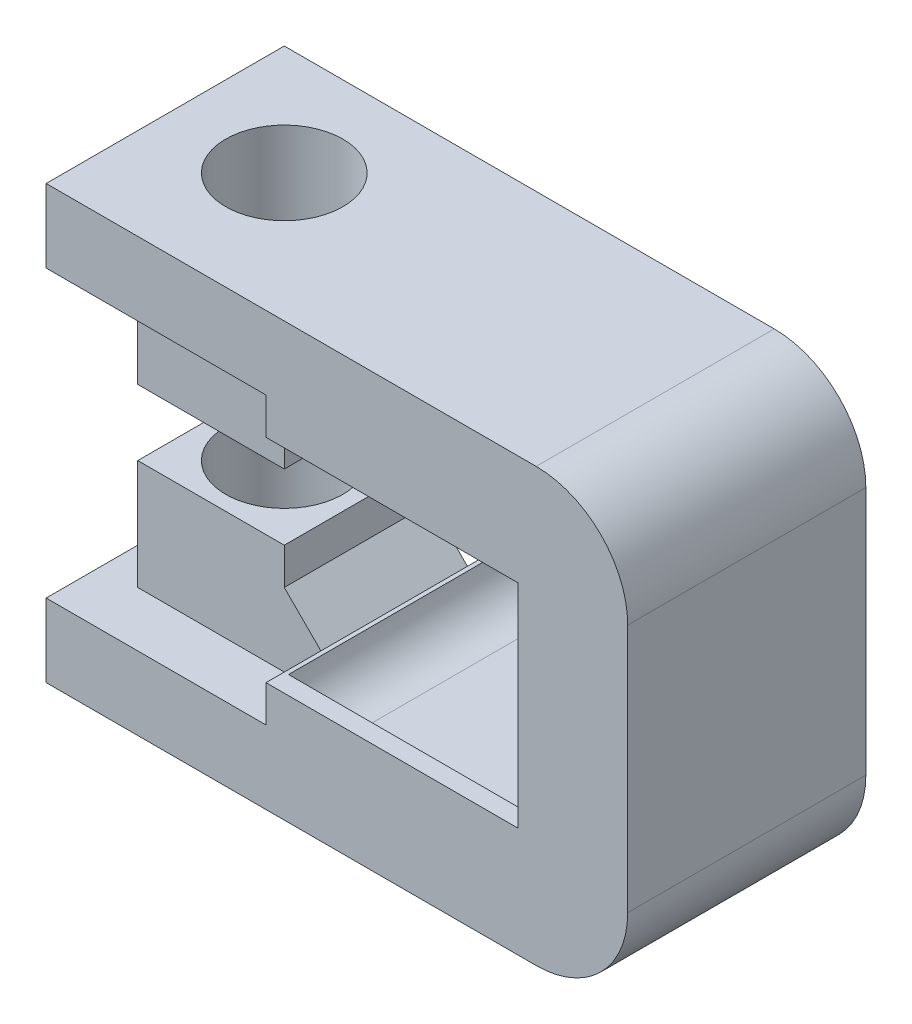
from build123d import *

# Parameters (mm, degrees)
EXTRUDE_1_DEPTH     = 12
EXTRUDE_2_DEPTH     = 1
SKETCH_2_W          = 8
SKETCH_2_H          = 8
SKETCH_2_R          = 3.2
EXTRUDE_3_DEPTH     = 10
CUT_EXTRUDE_2_REACH = 35.151
SKETCH_2_2_R        = 3.2
SKETCH_2_4_W        = 2
SKETCH_2_4_H        = 8
EXTRUDE_4_DEPTH     = 6
CHAMFER_1_SIZE      = 2
EXTRUDE_START       = -19.6
SKETCH_2_5_W        = 2
SKETCH_2_5_H        = 8
EXTRUDE_5_DEPTH     = 2
CHAMFER_2_SIZE      = 2
FILLET_1_R          = 5


with BuildPart() as part:
    # Sketch 1 → Extrude 1 (new body)
    with BuildSketch(Plane.XY):
        Polygon((-19.95, -7.8), (7.8, -7.8), (7.8, 7.8), (-19.95, 7.8), (-19.95, 11.8), (11.8, 11.8), (11.8, -11.8), (-19.95, -11.8), align=None)
        with BuildLine():
            Line((-5.15, 7.8), (-7.95, 7.8))
            Line((-7.95, 7.8), (-7.95, 5.8))
            Line((-7.95, 5.8), (-7.719046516, 5.8))
            ThreePointArc((-7.719046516, 5.8), (-6.77788206, 7.241052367), (-5.15, 7.8))
        make_face()
        with BuildLine():
            Line((-7.95, -5.8), (-7.95, -7.8))
            Line((-7.95, -7.8), (-5.15, -7.8))
            ThreePointArc((-5.15, -7.8), (-6.77788206, -7.241052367), (-7.719046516, -5.8))
            Line((-7.719046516, -5.8), (-7.95, -5.8))
        make_face()
        with BuildLine():
            ThreePointArc((7.8, -5.15), (7.02383297, -7.02383297), (5.15, -7.8))
            Line((5.15, -7.8), (7.8, -7.8))
            Line((7.8, -7.8), (7.8, -5.15))
        make_face()
        with BuildLine():
            ThreePointArc((5.15, 7.8), (7.02383297, 7.02383297), (7.8, 5.15))
            Line((7.8, 5.15), (7.8, 7.8))
            Line((7.8, 7.8), (5.15, 7.8))
        make_face()
    extrude(amount=-EXTRUDE_1_DEPTH)

    # Sketch 1_3 → Extrude 2 (add)
    with BuildSketch(Plane.XY):
        Polygon((-7.95, -7.8), (-19.95, -7.8), (-19.95, -11.8), (11.8, -11.8), (11.8, 11.8), (-19.95, 11.8), (-19.95, 7.8), (-7.95, 7.8), (-7.95, 5.8), (5.8, 5.8), (5.8, -5.8), (-7.95, -5.8), align=None)
    extrude(amount=EXTRUDE_2_DEPTH)

    # Sketch 2 → Extrude 3 (add)
    with BuildSketch(Plane.XZ.offset(11.8)):
        with Locations((-13.95, -6)):
            Rectangle(SKETCH_2_W, SKETCH_2_H)
        with Locations(Location((-13.95, -6, 0), (0, 0, 270))):
            Circle(SKETCH_2_R, mode=Mode.SUBTRACT)
    extrude_3 = extrude(amount=-EXTRUDE_3_DEPTH)

    # Sketch 2_2 → Cut-Extrude 2 (cut, up to next)
    with BuildSketch(Plane.XZ.offset(11.8), mode=Mode.PRIVATE) as cut_extrude_2_sk1:
        with Locations(Location((-13.95, -6, 0), (0, 0, 270))):
            Circle(SKETCH_2_2_R)
    cut_extrude_2_tool1 = extrude(cut_extrude_2_sk1.sketch, amount=-CUT_EXTRUDE_2_REACH, mode=Mode.PRIVATE) & part.part
    cut_extrude_2 = cut_extrude_2_tool1.solids().sort_by_distance((-13.95, -11.8, -6))[0]
    add(cut_extrude_2, mode=Mode.SUBTRACT)

    # Sketch 2_4 → Extrude 4 (add)
    with BuildSketch(Plane.XZ.offset(11.8)):
        with Locations((-8.95, -6)):
            Rectangle(SKETCH_2_4_W, SKETCH_2_4_H)
    extrude(amount=-EXTRUDE_4_DEPTH)

    # Chamfer 1
    chamfer_1_edges = [part.edges().sort_by_distance(p)[0] for p in [
        (-9.95, -5.8, -6),
    ]]
    chamfer(chamfer_1_edges, length=CHAMFER_1_SIZE)

    # Mirror 6: Extrude 3, Cut-Extrude 2 across plane
    add(extrude_3.mirror(Plane.ZX))
    add(cut_extrude_2.mirror(Plane.ZX), mode=Mode.SUBTRACT)

    # Sketch 2_5 → Extrude 5 (add)
    with BuildSketch(Plane.XZ.offset(11.8).offset(EXTRUDE_START)):
        with Locations((-8.95, -6)):
            Rectangle(SKETCH_2_5_W, SKETCH_2_5_H)
    extrude(amount=EXTRUDE_5_DEPTH)

    # Chamfer 2
    chamfer_2_edges = [part.edges().sort_by_distance(p)[0] for p in [
        (-9.95, 5.8, -6),
    ]]
    chamfer(chamfer_2_edges, length=CHAMFER_2_SIZE)

    # Fillet 1
    fillet_1_edges = [part.edges().sort_by_distance(p)[0] for p in [
        (11.8, 11.8, -5.5),
        (11.8, -11.8, -5.5),
    ]]
    fillet(fillet_1_edges, radius=FILLET_1_R)


solid = part.part
